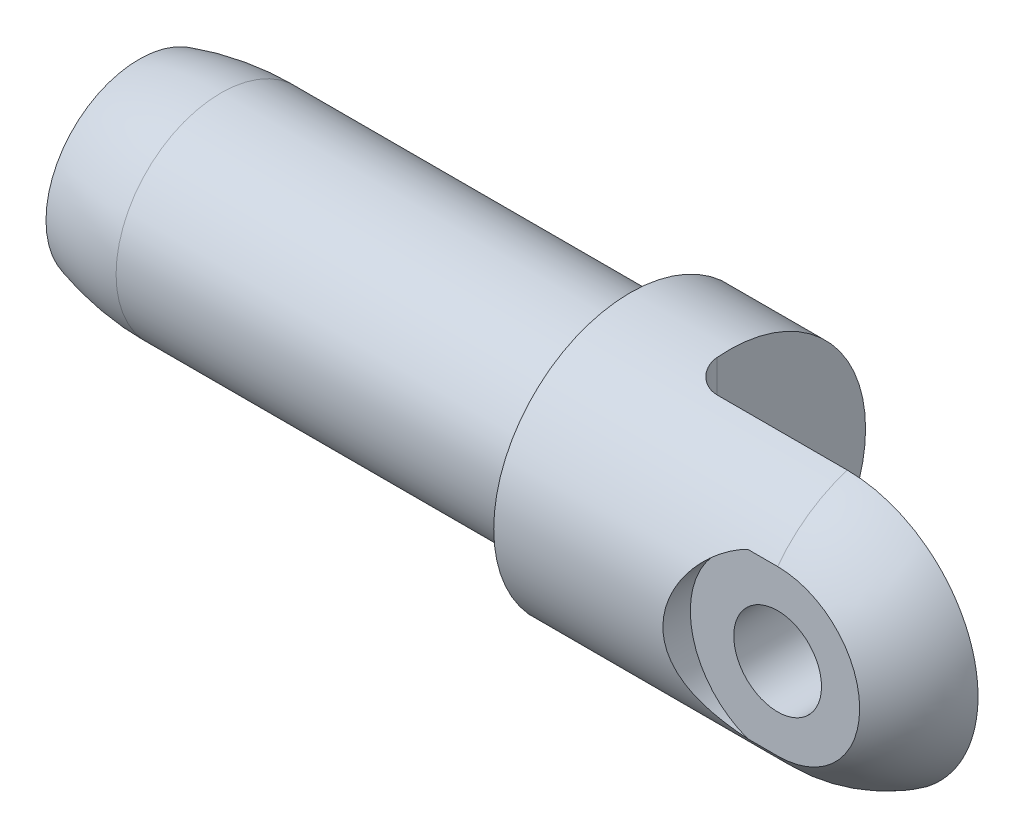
ISO-10303-21;
HEADER;
FILE_DESCRIPTION(('STEP AP214'),'2;1');
FILE_NAME('part.step','',(''),(''),'','','');
FILE_SCHEMA(('AUTOMOTIVE_DESIGN { 1 0 10303 214 1 1 1 1 }'));
ENDSEC;
DATA;
#1=APPLICATION_CONTEXT('core data for automotive mechanical design processes');
#2=APPLICATION_PROTOCOL_DEFINITION('international standard','automotive_design',2000,#1);
#3=PRODUCT_CONTEXT('',#1,'mechanical');
#4=PRODUCT('Part','Part','',(#3));
#5=PRODUCT_RELATED_PRODUCT_CATEGORY('part','',(#4));
#6=PRODUCT_DEFINITION_FORMATION('','',#4);
#7=PRODUCT_DEFINITION_CONTEXT('part definition',#1,'design');
#8=PRODUCT_DEFINITION('design','',#6,#7);
#9=PRODUCT_DEFINITION_SHAPE('','',#8);
#10=(LENGTH_UNIT() NAMED_UNIT(*) SI_UNIT(.MILLI.,.METRE.));
#11=(NAMED_UNIT(*) PLANE_ANGLE_UNIT() SI_UNIT($,.RADIAN.));
#12=(NAMED_UNIT(*) SI_UNIT($,.STERADIAN.) SOLID_ANGLE_UNIT());
#13=UNCERTAINTY_MEASURE_WITH_UNIT(LENGTH_MEASURE(1.E-05),#10,'distance_accuracy_value','');
#14=(GEOMETRIC_REPRESENTATION_CONTEXT(3) GLOBAL_UNCERTAINTY_ASSIGNED_CONTEXT((#13)) GLOBAL_UNIT_ASSIGNED_CONTEXT((#10,
#11,#12)) REPRESENTATION_CONTEXT('',''));
#15=CARTESIAN_POINT('',(0.,0.,0.));
#16=DIRECTION('',(0.,0.,1.));
#17=DIRECTION('',(1.,0.,0.));
#18=AXIS2_PLACEMENT_3D('',#15,#16,#17);
#19=CARTESIAN_POINT('',(-13.6525,0.,0.));
#20=DIRECTION('',(-1.,0.,0.));
#21=DIRECTION('',(0.,0.,-1.));
#22=AXIS2_PLACEMENT_3D('',#19,#20,#21);
#23=SPHERICAL_SURFACE('',#22,7.93749999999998);
#24=CARTESIAN_POINT('',(-13.6525,0.,6.34238));
#25=DIRECTION('',(0.,0.,-1.));
#26=DIRECTION('',(-1.,0.,0.));
#27=AXIS2_PLACEMENT_3D('',#24,#25,#26);
#28=CIRCLE('',#27,4.77264310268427);
#29=CARTESIAN_POINT('',(-13.6525,-4.77264310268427,6.34238));
#30=VERTEX_POINT('',#29);
#31=CARTESIAN_POINT('',(-13.6525,4.77264310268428,6.34237999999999));
#32=VERTEX_POINT('',#31);
#33=EDGE_CURVE('E31',#30,#32,#28,.F.);
#34=ORIENTED_EDGE('',*,*,#33,.F.);
#35=CARTESIAN_POINT('',(-13.6525,0.,0.));
#36=DIRECTION('',(-1.,0.,0.));
#37=DIRECTION('',(0.,0.,1.));
#38=AXIS2_PLACEMENT_3D('',#35,#36,#37);
#39=CIRCLE('',#38,7.93749999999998);
#40=CARTESIAN_POINT('',(-13.6525,-7.60119137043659,2.286));
#41=VERTEX_POINT('',#40);
#42=EDGE_CURVE('E153',#41,#30,#39,.T.);
#43=ORIENTED_EDGE('',*,*,#42,.F.);
#44=CARTESIAN_POINT('',(-13.6525,0.,2.286));
#45=DIRECTION('',(0.,0.,1.));
#46=DIRECTION('',(1.,0.,0.));
#47=AXIS2_PLACEMENT_3D('',#44,#45,#46);
#48=CIRCLE('',#47,7.60119137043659);
#49=CARTESIAN_POINT('',(-13.6525,7.60119137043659,2.286));
#50=VERTEX_POINT('',#49);
#51=EDGE_CURVE('E128',#50,#41,#48,.F.);
#52=ORIENTED_EDGE('',*,*,#51,.F.);
#53=EDGE_CURVE('E156',#32,#50,#39,.T.);
#54=ORIENTED_EDGE('',*,*,#53,.F.);
#55=EDGE_LOOP('',(#34,#43,#52,#54));
#56=FACE_BOUND('',#55,.T.);
#57=ADVANCED_FACE('F15',(#56),#23,.T.);
#58=CARTESIAN_POINT('',(-57.15,0.,0.));
#59=DIRECTION('',(-1.,0.,0.));
#60=DIRECTION('',(0.,0.,1.));
#61=AXIS2_PLACEMENT_3D('',#58,#59,#60);
#62=CYLINDRICAL_SURFACE('',#61,7.9375);
#63=CARTESIAN_POINT('',(-28.575,0.,0.));
#64=DIRECTION('',(-1.,0.,0.));
#65=DIRECTION('',(0.,0.,1.));
#66=AXIS2_PLACEMENT_3D('',#63,#64,#65);
#67=CIRCLE('',#66,7.93750000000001);
#68=CARTESIAN_POINT('',(-28.575,0.,7.93750000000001));
#69=VERTEX_POINT('',#68);
#70=EDGE_CURVE('E139',#69,#69,#67,.T.);
#71=ORIENTED_EDGE('',*,*,#70,.F.);
#72=EDGE_LOOP('',(#71));
#73=FACE_BOUND('',#72,.T.);
#74=CARTESIAN_POINT('',(-22.8162612,0.,0.));
#75=DIRECTION('',(-1.,0.,0.));
#76=DIRECTION('',(0.,0.,1.));
#77=AXIS2_PLACEMENT_3D('',#74,#75,#76);
#78=CIRCLE('',#77,7.9375);
#79=CARTESIAN_POINT('',(-22.8162612,7.90670626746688,0.698500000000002));
#80=VERTEX_POINT('',#79);
#81=CARTESIAN_POINT('',(-22.8162612,-7.90670626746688,0.698500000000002));
#82=VERTEX_POINT('',#81);
#83=EDGE_CURVE('E124',#80,#82,#78,.T.);
#84=ORIENTED_EDGE('',*,*,#83,.T.);
#85=CARTESIAN_POINT('',(-22.8162612,-7.90670626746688,0.698500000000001));
#86=CARTESIAN_POINT('',(-22.8162613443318,-7.90274986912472,0.743309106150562));
#87=CARTESIAN_POINT('',(-22.8143629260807,-7.89840985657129,0.788060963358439));
#88=CARTESIAN_POINT('',(-22.8068094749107,-7.88901098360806,0.877162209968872));
#89=CARTESIAN_POINT('',(-22.8011551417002,-7.8839522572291,0.921511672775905));
#90=CARTESIAN_POINT('',(-22.7786570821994,-7.86779622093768,1.0533204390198));
#91=CARTESIAN_POINT('',(-22.7562778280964,-7.85569793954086,1.13977644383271));
#92=CARTESIAN_POINT('',(-22.6975333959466,-7.82954781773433,1.30740367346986));
#93=CARTESIAN_POINT('',(-22.6611705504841,-7.8154963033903,1.38857577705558));
#94=CARTESIAN_POINT('',(-22.5755248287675,-7.7863580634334,1.54361885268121));
#95=CARTESIAN_POINT('',(-22.5262386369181,-7.7712710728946,1.61748794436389));
#96=CARTESIAN_POINT('',(-22.4150912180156,-7.74088462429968,1.75721981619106));
#97=CARTESIAN_POINT('',(-22.3530248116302,-7.72558607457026,1.82291965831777));
#98=CARTESIAN_POINT('',(-22.2184708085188,-7.69626643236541,1.94299195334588));
#99=CARTESIAN_POINT('',(-22.145981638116,-7.68224553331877,1.99736269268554));
#100=CARTESIAN_POINT('',(-21.9925159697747,-7.65670576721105,2.09313825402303));
#101=CARTESIAN_POINT('',(-21.9115418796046,-7.64518619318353,2.13454674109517));
#102=CARTESIAN_POINT('',(-21.7433726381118,-7.62574114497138,2.2030105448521));
#103=CARTESIAN_POINT('',(-21.6561840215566,-7.61781195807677,2.23008069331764));
#104=CARTESIAN_POINT('',(-21.5117397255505,-7.60849396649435,2.26161085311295));
#105=CARTESIAN_POINT('',(-21.4555480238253,-7.60576709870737,2.27074472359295));
#106=CARTESIAN_POINT('',(-21.3425017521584,-7.60211143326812,2.28294121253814));
#107=CARTESIAN_POINT('',(-21.2856477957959,-7.60118108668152,2.28600906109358));
#108=CARTESIAN_POINT('',(-21.2287612,-7.60119137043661,2.286));
#109=B_SPLINE_CURVE_WITH_KNOTS('',3,(#85,#86,#87,#88,#89,#90,#91,#92,#93,#94,#95,#96,#97,#98,
#99,#100,#101,#102,#103,#104,#105,#106,#107,#108),.UNSPECIFIED.,.F.,.F.,(4,2,2,2,2,2,2,2,2,2,2,
4),(0.,0.134863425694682,0.269701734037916,0.53867581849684,0.80760505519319,1.0766033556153,
1.35031433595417,1.62406668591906,1.89774156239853,2.17113279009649,2.34178737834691,
2.5122947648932),.UNSPECIFIED.);
#110=CARTESIAN_POINT('',(-21.2287612,-7.60119137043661,2.286));
#111=VERTEX_POINT('',#110);
#112=EDGE_CURVE('E69',#82,#111,#109,.T.);
#113=ORIENTED_EDGE('',*,*,#112,.T.);
#114=DIRECTION('',(-1.,0.,0.));
#115=VECTOR('',#114,1.);
#116=CARTESIAN_POINT('',(-57.15,-7.60119137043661,2.28600000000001));
#117=LINE('',#116,#115);
#118=EDGE_CURVE('E160',#111,#41,#117,.F.);
#119=ORIENTED_EDGE('',*,*,#118,.T.);
#120=ORIENTED_EDGE('',*,*,#42,.T.);
#121=DIRECTION('',(-1.,0.,0.));
#122=VECTOR('',#121,1.);
#123=CARTESIAN_POINT('',(-57.15,-4.77264310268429,6.34238000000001));
#124=LINE('',#123,#122);
#125=CARTESIAN_POINT('',(-15.3926947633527,-4.77264310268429,6.34238));
#126=VERTEX_POINT('',#125);
#127=EDGE_CURVE('E10',#30,#126,#124,.T.);
#128=ORIENTED_EDGE('',*,*,#127,.T.);
#129=CARTESIAN_POINT('',(-15.3926947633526,-4.77264310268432,6.34237999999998));
#130=CARTESIAN_POINT('',(-15.5334553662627,-4.72131093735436,6.38101004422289));
#131=CARTESIAN_POINT('',(-15.6710232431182,-4.66410489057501,6.42308173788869));
#132=CARTESIAN_POINT('',(-15.9391567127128,-4.53866781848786,6.51231928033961));
#133=CARTESIAN_POINT('',(-16.0697286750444,-4.4704470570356,6.5594803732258));
#134=CARTESIAN_POINT('',(-16.3235094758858,-4.32360960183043,6.65718306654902));
#135=CARTESIAN_POINT('',(-16.4467187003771,-4.24499345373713,6.70772448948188));
#136=CARTESIAN_POINT('',(-16.6854537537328,-4.07784627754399,6.81063206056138));
#137=CARTESIAN_POINT('',(-16.8009775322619,-3.98931262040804,6.86299869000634));
#138=CARTESIAN_POINT('',(-17.0235847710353,-3.80304950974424,6.96793466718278));
#139=CARTESIAN_POINT('',(-17.1306926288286,-3.70534858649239,7.0205029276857));
#140=CARTESIAN_POINT('',(-17.3364055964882,-3.50089516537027,7.12466147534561));
#141=CARTESIAN_POINT('',(-17.435011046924,-3.39414303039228,7.17625180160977));
#142=CARTESIAN_POINT('',(-17.6232267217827,-3.17189870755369,7.27721563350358));
#143=CARTESIAN_POINT('',(-17.7128327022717,-3.05640244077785,7.32658808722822));
#144=CARTESIAN_POINT('',(-17.8823509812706,-2.81713605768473,7.42187523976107));
#145=CARTESIAN_POINT('',(-17.9622627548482,-2.69336549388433,7.46778975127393));
#146=CARTESIAN_POINT('',(-18.1131903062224,-2.43545136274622,7.55588723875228));
#147=CARTESIAN_POINT('',(-18.1839870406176,-2.30114582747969,7.59797299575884));
#148=CARTESIAN_POINT('',(-18.3137882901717,-2.02534024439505,7.67609467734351));
#149=CARTESIAN_POINT('',(-18.372799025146,-1.88384404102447,7.71213379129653));
#150=CARTESIAN_POINT('',(-18.4781258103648,-1.59479349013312,7.77704649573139));
#151=CARTESIAN_POINT('',(-18.5244565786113,-1.44724639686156,7.80592839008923));
#152=CARTESIAN_POINT('',(-18.603683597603,-1.14727033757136,7.85562031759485));
#153=CARTESIAN_POINT('',(-18.6365828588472,-0.994842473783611,7.87643215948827));
#154=CARTESIAN_POINT('',(-18.68441043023,-0.70986460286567,7.90679108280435));
#155=CARTESIAN_POINT('',(-18.7012964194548,-0.577769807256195,7.91756101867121));
#156=CARTESIAN_POINT('',(-18.7246414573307,-0.312295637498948,7.93246764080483));
#157=CARTESIAN_POINT('',(-18.7311017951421,-0.178916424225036,7.93660514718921));
#158=CARTESIAN_POINT('',(-18.7334908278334,0.0879343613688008,7.9381341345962));
#159=CARTESIAN_POINT('',(-18.7294225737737,0.221405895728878,7.93552756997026));
#160=CARTESIAN_POINT('',(-18.7108285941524,0.487313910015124,7.9236445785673));
#161=CARTESIAN_POINT('',(-18.6963032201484,0.619750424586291,7.91436837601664));
#162=CARTESIAN_POINT('',(-18.6588630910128,0.870186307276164,7.89056331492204));
#163=CARTESIAN_POINT('',(-18.6368597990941,0.988377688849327,7.87660671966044));
#164=CARTESIAN_POINT('',(-18.5847262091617,1.22226066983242,7.8437209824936));
#165=CARTESIAN_POINT('',(-18.5545934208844,1.33795149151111,7.82479031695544));
#166=CARTESIAN_POINT('',(-18.4525094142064,1.68013329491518,7.76110292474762));
#167=CARTESIAN_POINT('',(-18.3688368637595,1.90196721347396,7.70942751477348));
#168=CARTESIAN_POINT('',(-18.1674288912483,2.34179996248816,7.58783595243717));
#169=CARTESIAN_POINT('',(-18.0479005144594,2.5587047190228,7.51698616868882));
#170=CARTESIAN_POINT('',(-17.7808727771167,2.97039005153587,7.36403315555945));
#171=CARTESIAN_POINT('',(-17.6333416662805,3.16514510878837,7.28191718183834));
#172=CARTESIAN_POINT('',(-17.2892360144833,3.55791082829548,7.09921868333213));
#173=CARTESIAN_POINT('',(-17.0886180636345,3.75195102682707,6.99772248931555));
#174=CARTESIAN_POINT('',(-16.6580691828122,4.10491003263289,6.7966734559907));
#175=CARTESIAN_POINT('',(-16.4281811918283,4.26387937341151,6.69711801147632));
#176=CARTESIAN_POINT('',(-16.0597434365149,4.47576457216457,6.55583609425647));
#177=CARTESIAN_POINT('',(-15.9309162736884,4.54274245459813,6.50946468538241));
#178=CARTESIAN_POINT('',(-15.6666686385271,4.6659118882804,6.42174988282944));
#179=CARTESIAN_POINT('',(-15.5312515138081,4.72210884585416,6.38040397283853));
#180=CARTESIAN_POINT('',(-15.3926947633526,4.77264310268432,6.34237999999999));
#181=B_SPLINE_CURVE_WITH_KNOTS('',3,(#129,#130,#131,#132,#133,#134,#135,#136,#137,#138,#139,
#140,#141,#142,#143,#144,#145,#146,#147,#148,#149,#150,#151,#152,#153,#154,#155,#156,#157,#158,
#159,#160,#161,#162,#163,#164,#165,#166,#167,#168,#169,#170,#171,#172,#173,#174,#175,#176,#177,
#178,#179,#180),.UNSPECIFIED.,.F.,.F.,(4,2,2,2,2,2,2,2,2,2,2,2,2,2,2,2,2,2,2,2,2,2,2,2,2,4),(0.,
0.463864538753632,0.927299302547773,1.39070975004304,1.85424333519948,2.31637935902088,
2.77849686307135,3.24083127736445,3.7031907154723,4.17514579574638,4.64685114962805,
5.11800663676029,5.58905646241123,5.98931668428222,6.38952740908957,6.78962217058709,
7.18970348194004,7.55237461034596,7.91515696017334,8.64001754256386,9.4099019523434,
10.1806645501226,11.068109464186,11.9542671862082,12.4110005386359,12.8675042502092),.UNSPECIFIED.);
#182=CARTESIAN_POINT('',(-15.3926947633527,4.77264310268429,6.34238));
#183=VERTEX_POINT('',#182);
#184=EDGE_CURVE('E24',#126,#183,#181,.T.);
#185=ORIENTED_EDGE('',*,*,#184,.T.);
#186=DIRECTION('',(-1.,0.,0.));
#187=VECTOR('',#186,1.);
#188=CARTESIAN_POINT('',(-57.15,4.77264310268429,6.34238000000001));
#189=LINE('',#188,#187);
#190=EDGE_CURVE('E61',#183,#32,#189,.F.);
#191=ORIENTED_EDGE('',*,*,#190,.T.);
#192=ORIENTED_EDGE('',*,*,#53,.T.);
#193=DIRECTION('',(-1.,0.,0.));
#194=VECTOR('',#193,1.);
#195=CARTESIAN_POINT('',(-57.15,7.60119137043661,2.28600000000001));
#196=LINE('',#195,#194);
#197=CARTESIAN_POINT('',(-21.2287612,7.60119137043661,2.286));
#198=VERTEX_POINT('',#197);
#199=EDGE_CURVE('E157',#50,#198,#196,.T.);
#200=ORIENTED_EDGE('',*,*,#199,.T.);
#201=CARTESIAN_POINT('',(-21.2287612,7.60119137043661,2.286));
#202=CARTESIAN_POINT('',(-21.2723240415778,7.60118888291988,2.28600076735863));
#203=CARTESIAN_POINT('',(-21.3158651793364,7.60173122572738,2.28420571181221));
#204=CARTESIAN_POINT('',(-21.4026192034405,7.60387818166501,2.27705152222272));
#205=CARTESIAN_POINT('',(-21.4458321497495,7.6054825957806,2.27169305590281));
#206=CARTESIAN_POINT('',(-21.5743013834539,7.6118346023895,2.25035848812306));
#207=CARTESIAN_POINT('',(-21.6586704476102,7.6181213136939,2.22912280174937));
#208=CARTESIAN_POINT('',(-21.8224517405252,7.63421803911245,2.17335028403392));
#209=CARTESIAN_POINT('',(-21.9018648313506,7.64402743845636,2.13881577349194));
#210=CARTESIAN_POINT('',(-22.0537814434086,7.66631016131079,2.0575144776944));
#211=CARTESIAN_POINT('',(-22.1262825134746,7.67878442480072,2.01074337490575));
#212=CARTESIAN_POINT('',(-22.2642522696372,7.70570588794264,1.905004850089));
#213=CARTESIAN_POINT('',(-22.3295057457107,7.72019385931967,1.84576725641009));
#214=CARTESIAN_POINT('',(-22.4492959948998,7.7497593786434,1.71740153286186));
#215=CARTESIAN_POINT('',(-22.503829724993,7.7648370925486,1.64827060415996));
#216=CARTESIAN_POINT('',(-22.6021942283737,7.79490581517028,1.4997493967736));
#217=CARTESIAN_POINT('',(-22.6456683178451,7.80988159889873,1.42011953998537));
#218=CARTESIAN_POINT('',(-22.7184940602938,7.83820273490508,1.25440504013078));
#219=CARTESIAN_POINT('',(-22.7478555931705,7.85154922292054,1.16832496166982));
#220=CARTESIAN_POINT('',(-22.7850993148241,7.87219899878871,1.01800664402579));
#221=CARTESIAN_POINT('',(-22.7967551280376,7.88012681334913,0.954764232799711));
#222=CARTESIAN_POINT('',(-22.8123405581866,7.89454169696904,0.827217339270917));
#223=CARTESIAN_POINT('',(-22.8162752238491,7.90102970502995,0.762913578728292));
#224=CARTESIAN_POINT('',(-22.8162612,7.90670626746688,0.698500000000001));
#225=B_SPLINE_CURVE_WITH_KNOTS('',3,(#201,#202,#203,#204,#205,#206,#207,#208,#209,#210,#211,
#212,#213,#214,#215,#216,#217,#218,#219,#220,#221,#222,#223,#224),.UNSPECIFIED.,.F.,.F.,(4,2,2,
2,2,2,2,2,2,2,2,4),(0.,0.130605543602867,0.261186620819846,0.521512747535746,0.781793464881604,
1.04216614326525,1.30890313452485,1.5757157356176,1.85027427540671,2.12464032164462,
2.31856344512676,2.51235972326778),.UNSPECIFIED.);
#226=EDGE_CURVE('E108',#198,#80,#225,.T.);
#227=ORIENTED_EDGE('',*,*,#226,.T.);
#228=EDGE_LOOP('',(#84,#113,#119,#120,#128,#185,#191,#192,#200,#227));
#229=FACE_BOUND('',#228,.T.);
#230=ADVANCED_FACE('F76',(#73,#229),#62,.T.);
#231=CARTESIAN_POINT('',(-57.15,0.,0.));
#232=DIRECTION('',(-1.,0.,0.));
#233=DIRECTION('',(0.,0.,1.));
#234=AXIS2_PLACEMENT_3D('',#231,#232,#233);
#235=CYLINDRICAL_SURFACE('',#234,6.096);
#236=CARTESIAN_POINT('',(-52.3875,0.,0.));
#237=DIRECTION('',(-1.,0.,0.));
#238=DIRECTION('',(0.,0.,1.));
#239=AXIS2_PLACEMENT_3D('',#236,#237,#238);
#240=CIRCLE('',#239,6.096);
#241=CARTESIAN_POINT('',(-52.3875,0.,6.096));
#242=VERTEX_POINT('',#241);
#243=EDGE_CURVE('E131',#242,#242,#240,.T.);
#244=ORIENTED_EDGE('',*,*,#243,.F.);
#245=EDGE_LOOP('',(#244));
#246=FACE_BOUND('',#245,.T.);
#247=CARTESIAN_POINT('',(-28.575,0.,0.));
#248=DIRECTION('',(-1.,0.,0.));
#249=DIRECTION('',(0.,0.,1.));
#250=AXIS2_PLACEMENT_3D('',#247,#248,#249);
#251=CIRCLE('',#250,6.096);
#252=CARTESIAN_POINT('',(-28.575,0.,6.096));
#253=VERTEX_POINT('',#252);
#254=EDGE_CURVE('E136',#253,#253,#251,.T.);
#255=ORIENTED_EDGE('',*,*,#254,.T.);
#256=EDGE_LOOP('',(#255));
#257=FACE_BOUND('',#256,.T.);
#258=ADVANCED_FACE('F192',(#246,#257),#235,.T.);
#259=CARTESIAN_POINT('',(-28.575,0.,-6.096));
#260=DIRECTION('',(-1.,0.,0.));
#261=DIRECTION('',(0.,0.,1.));
#262=AXIS2_PLACEMENT_3D('',#259,#260,#261);
#263=PLANE('',#262);
#264=ORIENTED_EDGE('',*,*,#70,.T.);
#265=EDGE_LOOP('',(#264));
#266=FACE_BOUND('',#265,.T.);
#267=ORIENTED_EDGE('',*,*,#254,.F.);
#268=EDGE_LOOP('',(#267));
#269=FACE_BOUND('',#268,.T.);
#270=ADVANCED_FACE('F103',(#266,#269),#263,.T.);
#271=CARTESIAN_POINT('',(-21.2287612,-127.,0.698500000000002));
#272=DIRECTION('',(0.,1.,0.));
#273=DIRECTION('',(0.,0.,1.));
#274=AXIS2_PLACEMENT_3D('',#271,#272,#273);
#275=CYLINDRICAL_SURFACE('',#274,1.5875);
#276=DIRECTION('',(0.,1.,0.));
#277=VECTOR('',#276,1.);
#278=CARTESIAN_POINT('',(-21.2287612,-127.,2.286));
#279=LINE('',#278,#277);
#280=EDGE_CURVE('E162',#111,#198,#279,.T.);
#281=ORIENTED_EDGE('',*,*,#280,.F.);
#282=ORIENTED_EDGE('',*,*,#112,.F.);
#283=DIRECTION('',(0.,1.,0.));
#284=VECTOR('',#283,1.);
#285=CARTESIAN_POINT('',(-22.8162612,-127.,0.698500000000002));
#286=LINE('',#285,#284);
#287=EDGE_CURVE('E163',#82,#80,#286,.T.);
#288=ORIENTED_EDGE('',*,*,#287,.T.);
#289=ORIENTED_EDGE('',*,*,#226,.F.);
#290=EDGE_LOOP('',(#281,#282,#288,#289));
#291=FACE_BOUND('',#290,.T.);
#292=ADVANCED_FACE('F99',(#291),#275,.F.);
#293=CARTESIAN_POINT('',(-22.8162612,-127.,-0.698499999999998));
#294=DIRECTION('',(-1.,0.,0.));
#295=DIRECTION('',(0.,0.,1.));
#296=AXIS2_PLACEMENT_3D('',#293,#294,#295);
#297=PLANE('',#296);
#298=ORIENTED_EDGE('',*,*,#287,.F.);
#299=ORIENTED_EDGE('',*,*,#83,.F.);
#300=EDGE_LOOP('',(#298,#299));
#301=FACE_BOUND('',#300,.T.);
#302=ADVANCED_FACE('F97',(#301),#297,.F.);
#303=CARTESIAN_POINT('',(-21.2287612,-127.,2.286));
#304=DIRECTION('',(0.,0.,1.));
#305=DIRECTION('',(1.,0.,0.));
#306=AXIS2_PLACEMENT_3D('',#303,#304,#305);
#307=PLANE('',#306);
#308=CARTESIAN_POINT('',(-13.6525,0.,2.286));
#309=DIRECTION('',(0.,0.,1.));
#310=DIRECTION('',(1.,0.,0.));
#311=AXIS2_PLACEMENT_3D('',#308,#309,#310);
#312=CIRCLE('',#311,2.55269999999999);
#313=CARTESIAN_POINT('',(-11.0998,0.,2.286));
#314=VERTEX_POINT('',#313);
#315=EDGE_CURVE('E74',#314,#314,#312,.T.);
#316=ORIENTED_EDGE('',*,*,#315,.T.);
#317=EDGE_LOOP('',(#316));
#318=FACE_BOUND('',#317,.T.);
#319=ORIENTED_EDGE('',*,*,#51,.T.);
#320=ORIENTED_EDGE('',*,*,#118,.F.);
#321=ORIENTED_EDGE('',*,*,#280,.T.);
#322=ORIENTED_EDGE('',*,*,#199,.F.);
#323=EDGE_LOOP('',(#319,#320,#321,#322));
#324=FACE_BOUND('',#323,.T.);
#325=ADVANCED_FACE('F93',(#318,#324),#307,.F.);
#326=CARTESIAN_POINT('',(-13.6525,0.,260.34238));
#327=DIRECTION('',(0.,0.,-1.));
#328=DIRECTION('',(-1.,0.,0.));
#329=AXIS2_PLACEMENT_3D('',#326,#327,#328);
#330=CYLINDRICAL_SURFACE('',#329,5.08);
#331=CARTESIAN_POINT('',(-13.6525,0.,6.34238));
#332=DIRECTION('',(0.,0.,-1.));
#333=DIRECTION('',(-1.,0.,0.));
#334=AXIS2_PLACEMENT_3D('',#331,#332,#333);
#335=CIRCLE('',#334,5.08);
#336=EDGE_CURVE('E64',#126,#183,#335,.T.);
#337=ORIENTED_EDGE('',*,*,#336,.T.);
#338=ORIENTED_EDGE('',*,*,#184,.F.);
#339=EDGE_LOOP('',(#337,#338));
#340=FACE_BOUND('',#339,.T.);
#341=ADVANCED_FACE('F72',(#340),#330,.F.);
#342=CARTESIAN_POINT('',(-13.6525,0.,6.34238));
#343=DIRECTION('',(0.,0.,-1.));
#344=DIRECTION('',(-1.,0.,0.));
#345=AXIS2_PLACEMENT_3D('',#342,#343,#344);
#346=PLANE('',#345);
#347=CARTESIAN_POINT('',(-13.6525,0.,6.34238));
#348=DIRECTION('',(0.,0.,1.));
#349=DIRECTION('',(1.,0.,0.));
#350=AXIS2_PLACEMENT_3D('',#347,#348,#349);
#351=CIRCLE('',#350,2.55269999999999);
#352=CARTESIAN_POINT('',(-11.0998,0.,6.34238));
#353=VERTEX_POINT('',#352);
#354=EDGE_CURVE('E175',#353,#353,#351,.T.);
#355=ORIENTED_EDGE('',*,*,#354,.F.);
#356=EDGE_LOOP('',(#355));
#357=FACE_BOUND('',#356,.T.);
#358=ORIENTED_EDGE('',*,*,#33,.T.);
#359=ORIENTED_EDGE('',*,*,#190,.F.);
#360=ORIENTED_EDGE('',*,*,#336,.F.);
#361=ORIENTED_EDGE('',*,*,#127,.F.);
#362=EDGE_LOOP('',(#358,#359,#360,#361));
#363=FACE_BOUND('',#362,.T.);
#364=ADVANCED_FACE('F63',(#357,#363),#346,.F.);
#365=CARTESIAN_POINT('',(-13.6525,0.,6.34238));
#366=DIRECTION('',(0.,0.,1.));
#367=DIRECTION('',(1.,0.,0.));
#368=AXIS2_PLACEMENT_3D('',#365,#366,#367);
#369=CYLINDRICAL_SURFACE('',#368,2.55269999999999);
#370=ORIENTED_EDGE('',*,*,#354,.T.);
#371=EDGE_LOOP('',(#370));
#372=FACE_BOUND('',#371,.T.);
#373=ORIENTED_EDGE('',*,*,#315,.F.);
#374=EDGE_LOOP('',(#373));
#375=FACE_BOUND('',#374,.T.);
#376=ADVANCED_FACE('F180',(#372,#375),#369,.F.);
#377=CARTESIAN_POINT('',(-25.8125099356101,0.,0.));
#378=DIRECTION('',(-1.,0.,0.));
#379=DIRECTION('',(0.,-1.,0.));
#380=AXIS2_PLACEMENT_3D('',#377,#378,#379);
#381=CONICAL_SURFACE('',#380,0.,1.17809724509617);
#382=CARTESIAN_POINT('',(-27.559,0.,0.));
#383=DIRECTION('',(1.,0.,0.));
#384=DIRECTION('',(0.,1.,0.));
#385=AXIS2_PLACEMENT_3D('',#382,#383,#384);
#386=CIRCLE('',#385,4.2164);
#387=CARTESIAN_POINT('',(-27.559,4.2164,0.));
#388=VERTEX_POINT('',#387);
#389=EDGE_CURVE('E146',#388,#388,#386,.T.);
#390=ORIENTED_EDGE('',*,*,#389,.F.);
#391=EDGE_LOOP('',(#390));
#392=FACE_BOUND('',#391,.T.);
#393=CARTESIAN_POINT('',(-25.8125099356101,0.,0.));
#394=VERTEX_POINT('',#393);
#395=VERTEX_LOOP('',#394);
#396=FACE_BOUND('',#395,.T.);
#397=ADVANCED_FACE('F187',(#392,#396),#381,.F.);
#398=CARTESIAN_POINT('',(-25.8125099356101,0.,0.));
#399=DIRECTION('',(1.,0.,0.));
#400=DIRECTION('',(0.,1.,0.));
#401=AXIS2_PLACEMENT_3D('',#398,#399,#400);
#402=CYLINDRICAL_SURFACE('',#401,4.2164);
#403=CARTESIAN_POINT('',(-57.15,0.,0.));
#404=DIRECTION('',(1.,0.,0.));
#405=DIRECTION('',(0.,1.,0.));
#406=AXIS2_PLACEMENT_3D('',#403,#404,#405);
#407=CIRCLE('',#406,4.2164);
#408=CARTESIAN_POINT('',(-57.15,4.2164,0.));
#409=VERTEX_POINT('',#408);
#410=EDGE_CURVE('E150',#409,#409,#407,.T.);
#411=ORIENTED_EDGE('',*,*,#410,.F.);
#412=EDGE_LOOP('',(#411));
#413=FACE_BOUND('',#412,.T.);
#414=ORIENTED_EDGE('',*,*,#389,.T.);
#415=EDGE_LOOP('',(#414));
#416=FACE_BOUND('',#415,.T.);
#417=ADVANCED_FACE('F195',(#413,#416),#402,.F.);
#418=CARTESIAN_POINT('',(-57.15,7.9375,0.));
#419=DIRECTION('',(1.,0.,0.));
#420=DIRECTION('',(0.,0.,-1.));
#421=AXIS2_PLACEMENT_3D('',#418,#419,#420);
#422=PLANE('',#421);
#423=ORIENTED_EDGE('',*,*,#410,.T.);
#424=EDGE_LOOP('',(#423));
#425=FACE_BOUND('',#424,.T.);
#426=CARTESIAN_POINT('',(-57.15,0.,0.));
#427=DIRECTION('',(-1.,0.,0.));
#428=DIRECTION('',(0.,0.,1.));
#429=AXIS2_PLACEMENT_3D('',#426,#427,#428);
#430=CIRCLE('',#429,5.41069266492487);
#431=CARTESIAN_POINT('',(-57.15,0.,5.41069266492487));
#432=VERTEX_POINT('',#431);
#433=EDGE_CURVE('E143',#432,#432,#430,.T.);
#434=ORIENTED_EDGE('',*,*,#433,.T.);
#435=EDGE_LOOP('',(#434));
#436=FACE_BOUND('',#435,.T.);
#437=ADVANCED_FACE('F17',(#425,#436),#422,.F.);
#438=CARTESIAN_POINT('',(-52.3875,0.,0.));
#439=DIRECTION('',(-1.,0.,0.));
#440=DIRECTION('',(0.,0.,1.));
#441=AXIS2_PLACEMENT_3D('',#438,#439,#440);
#442=DEGENERATE_TOROIDAL_SURFACE('',#441,10.795,16.891,.F.);
#443=ORIENTED_EDGE('',*,*,#243,.T.);
#444=EDGE_LOOP('',(#443));
#445=FACE_BOUND('',#444,.T.);
#446=ORIENTED_EDGE('',*,*,#433,.F.);
#447=EDGE_LOOP('',(#446));
#448=FACE_BOUND('',#447,.T.);
#449=ADVANCED_FACE('F207',(#445,#448),#442,.F.);
#450=CLOSED_SHELL('',(#57,#230,#258,#270,#292,#302,#325,#341,#364,#376,#397,#417,#437,#449));
#451=MANIFOLD_SOLID_BREP('B1',#450);
#452=ADVANCED_BREP_SHAPE_REPRESENTATION('',(#18,#451),#14);
#453=SHAPE_DEFINITION_REPRESENTATION(#9,#452);
ENDSEC;
END-ISO-10303-21;
